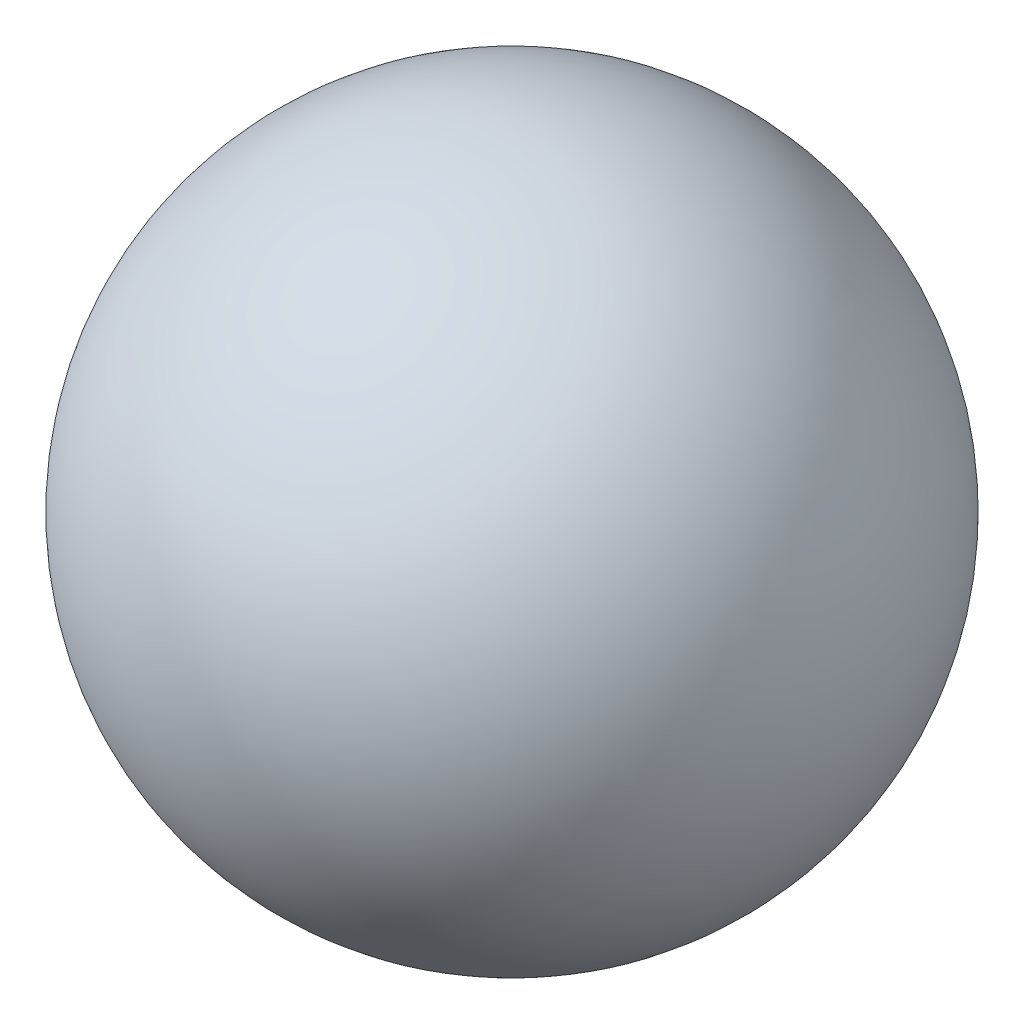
from build123d import *


with BuildPart() as part:
    # Esquisse1 → R_volution5 (revolve)
    with BuildSketch(Plane.XY):
        with BuildLine():
            Line((-0.069567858, -1.498385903), (-0.069567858, 1.501614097))
            ThreePointArc((-0.069567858, 1.501614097), (1.430432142, 0.001614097), (-0.069567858, -1.498385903))
        make_face()
    revolve(axis=Axis((-0.069567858, -1.498385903, 0), (0, 1, 0)))


solid = part.part
